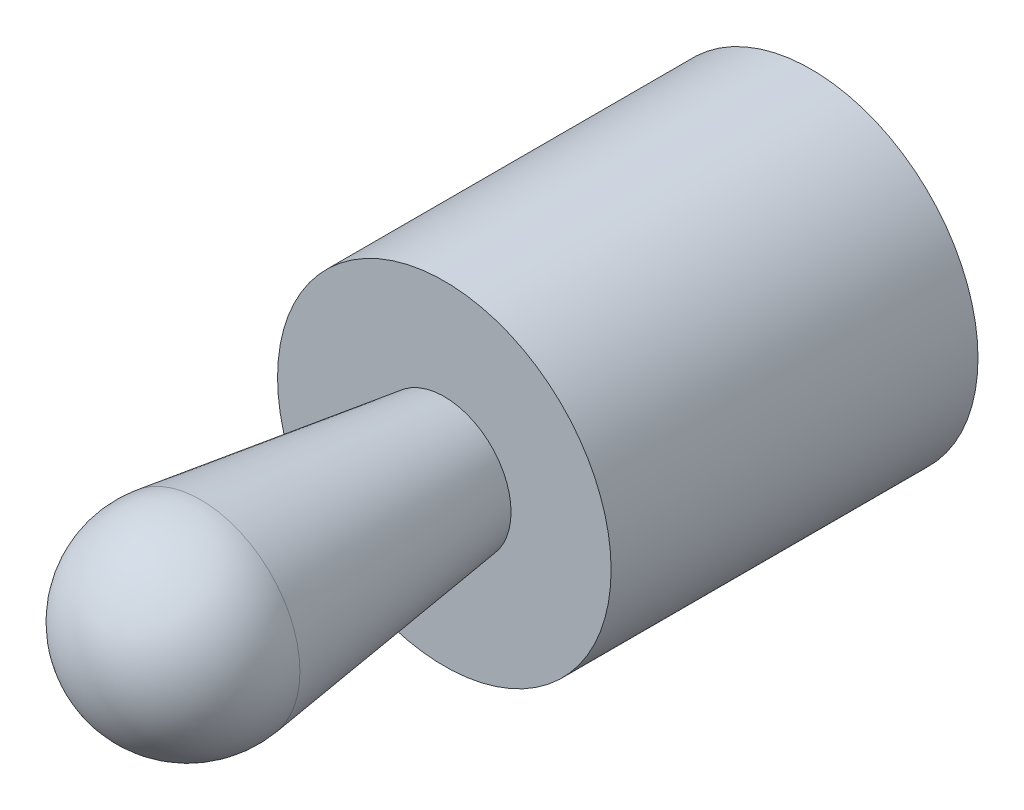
ISO-10303-21;
HEADER;
FILE_DESCRIPTION(('STEP AP214'),'2;1');
FILE_NAME('part.step','',(''),(''),'','','');
FILE_SCHEMA(('AUTOMOTIVE_DESIGN { 1 0 10303 214 1 1 1 1 }'));
ENDSEC;
DATA;
#1=APPLICATION_CONTEXT('core data for automotive mechanical design processes');
#2=APPLICATION_PROTOCOL_DEFINITION('international standard','automotive_design',2000,#1);
#3=PRODUCT_CONTEXT('',#1,'mechanical');
#4=PRODUCT('Part','Part','',(#3));
#5=PRODUCT_RELATED_PRODUCT_CATEGORY('part','',(#4));
#6=PRODUCT_DEFINITION_FORMATION('','',#4);
#7=PRODUCT_DEFINITION_CONTEXT('part definition',#1,'design');
#8=PRODUCT_DEFINITION('design','',#6,#7);
#9=PRODUCT_DEFINITION_SHAPE('','',#8);
#10=(LENGTH_UNIT() NAMED_UNIT(*) SI_UNIT(.MILLI.,.METRE.));
#11=(NAMED_UNIT(*) PLANE_ANGLE_UNIT() SI_UNIT($,.RADIAN.));
#12=(NAMED_UNIT(*) SI_UNIT($,.STERADIAN.) SOLID_ANGLE_UNIT());
#13=UNCERTAINTY_MEASURE_WITH_UNIT(LENGTH_MEASURE(1.E-05),#10,'distance_accuracy_value','');
#14=(GEOMETRIC_REPRESENTATION_CONTEXT(3) GLOBAL_UNCERTAINTY_ASSIGNED_CONTEXT((#13)) GLOBAL_UNIT_ASSIGNED_CONTEXT((#10,
#11,#12)) REPRESENTATION_CONTEXT('',''));
#15=CARTESIAN_POINT('',(0.,0.,0.));
#16=DIRECTION('',(0.,0.,1.));
#17=DIRECTION('',(1.,0.,0.));
#18=AXIS2_PLACEMENT_3D('',#15,#16,#17);
#19=CARTESIAN_POINT('',(0.,0.,0.));
#20=DIRECTION('',(0.,0.,1.));
#21=DIRECTION('',(1.,0.,0.));
#22=AXIS2_PLACEMENT_3D('',#19,#20,#21);
#23=PLANE('',#22);
#24=CARTESIAN_POINT('',(0.,0.,0.));
#25=DIRECTION('',(0.,0.,1.));
#26=DIRECTION('',(1.,0.,0.));
#27=AXIS2_PLACEMENT_3D('',#24,#25,#26);
#28=CIRCLE('',#27,5.);
#29=CARTESIAN_POINT('',(5.,0.,0.));
#30=VERTEX_POINT('',#29);
#31=EDGE_CURVE('E8',#30,#30,#28,.T.);
#32=ORIENTED_EDGE('',*,*,#31,.F.);
#33=EDGE_LOOP('',(#32));
#34=FACE_BOUND('',#33,.T.);
#35=ADVANCED_FACE('F12',(#34),#23,.F.);
#36=CARTESIAN_POINT('',(0.,0.,20.));
#37=DIRECTION('',(0.,0.,1.));
#38=DIRECTION('',(1.,0.,0.));
#39=AXIS2_PLACEMENT_3D('',#36,#37,#38);
#40=CYLINDRICAL_SURFACE('',#39,5.);
#41=CARTESIAN_POINT('',(0.,0.,11.));
#42=DIRECTION('',(0.,0.,1.));
#43=DIRECTION('',(1.,0.,0.));
#44=AXIS2_PLACEMENT_3D('',#41,#42,#43);
#45=CIRCLE('',#44,5.);
#46=CARTESIAN_POINT('',(5.,0.,11.));
#47=VERTEX_POINT('',#46);
#48=EDGE_CURVE('E18',#47,#47,#45,.T.);
#49=ORIENTED_EDGE('',*,*,#48,.F.);
#50=EDGE_LOOP('',(#49));
#51=FACE_BOUND('',#50,.T.);
#52=ORIENTED_EDGE('',*,*,#31,.T.);
#53=EDGE_LOOP('',(#52));
#54=FACE_BOUND('',#53,.T.);
#55=ADVANCED_FACE('F45',(#51,#54),#40,.T.);
#56=CARTESIAN_POINT('',(-2.,0.,11.));
#57=DIRECTION('',(0.,0.,1.));
#58=DIRECTION('',(1.,0.,0.));
#59=AXIS2_PLACEMENT_3D('',#56,#57,#58);
#60=PLANE('',#59);
#61=ORIENTED_EDGE('',*,*,#48,.T.);
#62=EDGE_LOOP('',(#61));
#63=FACE_BOUND('',#62,.T.);
#64=CARTESIAN_POINT('',(0.,0.,11.));
#65=DIRECTION('',(0.,0.,1.));
#66=DIRECTION('',(1.,0.,0.));
#67=AXIS2_PLACEMENT_3D('',#64,#65,#66);
#68=CIRCLE('',#67,2.);
#69=CARTESIAN_POINT('',(2.,0.,11.));
#70=VERTEX_POINT('',#69);
#71=EDGE_CURVE('E22',#70,#70,#68,.T.);
#72=ORIENTED_EDGE('',*,*,#71,.F.);
#73=EDGE_LOOP('',(#72));
#74=FACE_BOUND('',#73,.T.);
#75=ADVANCED_FACE('F36',(#63,#74),#60,.T.);
#76=CARTESIAN_POINT('',(0.,0.,18.3035558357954));
#77=DIRECTION('',(0.,0.,1.));
#78=DIRECTION('',(1.,0.,0.));
#79=AXIS2_PLACEMENT_3D('',#76,#77,#78);
#80=CONICAL_SURFACE('',#79,2.9736899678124,0.132535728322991);
#81=ORIENTED_EDGE('',*,*,#71,.T.);
#82=EDGE_LOOP('',(#81));
#83=FACE_BOUND('',#82,.T.);
#84=CARTESIAN_POINT('',(0.,0.,18.3035558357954));
#85=DIRECTION('',(0.,0.,1.));
#86=DIRECTION('',(1.,0.,0.));
#87=AXIS2_PLACEMENT_3D('',#84,#85,#86);
#88=CIRCLE('',#87,2.9736899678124);
#89=CARTESIAN_POINT('',(2.9736899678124,0.,18.3035558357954));
#90=VERTEX_POINT('',#89);
#91=EDGE_CURVE('E26',#90,#90,#88,.T.);
#92=ORIENTED_EDGE('',*,*,#91,.F.);
#93=EDGE_LOOP('',(#92));
#94=FACE_BOUND('',#93,.T.);
#95=ADVANCED_FACE('F34',(#83,#94),#80,.T.);
#96=CARTESIAN_POINT('',(0.,0.,18.7));
#97=DIRECTION('',(0.,0.,1.));
#98=DIRECTION('',(1.,0.,0.));
#99=AXIS2_PLACEMENT_3D('',#96,#97,#98);
#100=SPHERICAL_SURFACE('',#99,3.);
#101=ORIENTED_EDGE('',*,*,#91,.T.);
#102=EDGE_LOOP('',(#101));
#103=FACE_BOUND('',#102,.T.);
#104=ADVANCED_FACE('F32',(#103),#100,.T.);
#105=CLOSED_SHELL('',(#35,#55,#75,#95,#104));
#106=MANIFOLD_SOLID_BREP('B1',#105);
#107=ADVANCED_BREP_SHAPE_REPRESENTATION('',(#18,#106),#14);
#108=SHAPE_DEFINITION_REPRESENTATION(#9,#107);
ENDSEC;
END-ISO-10303-21;
